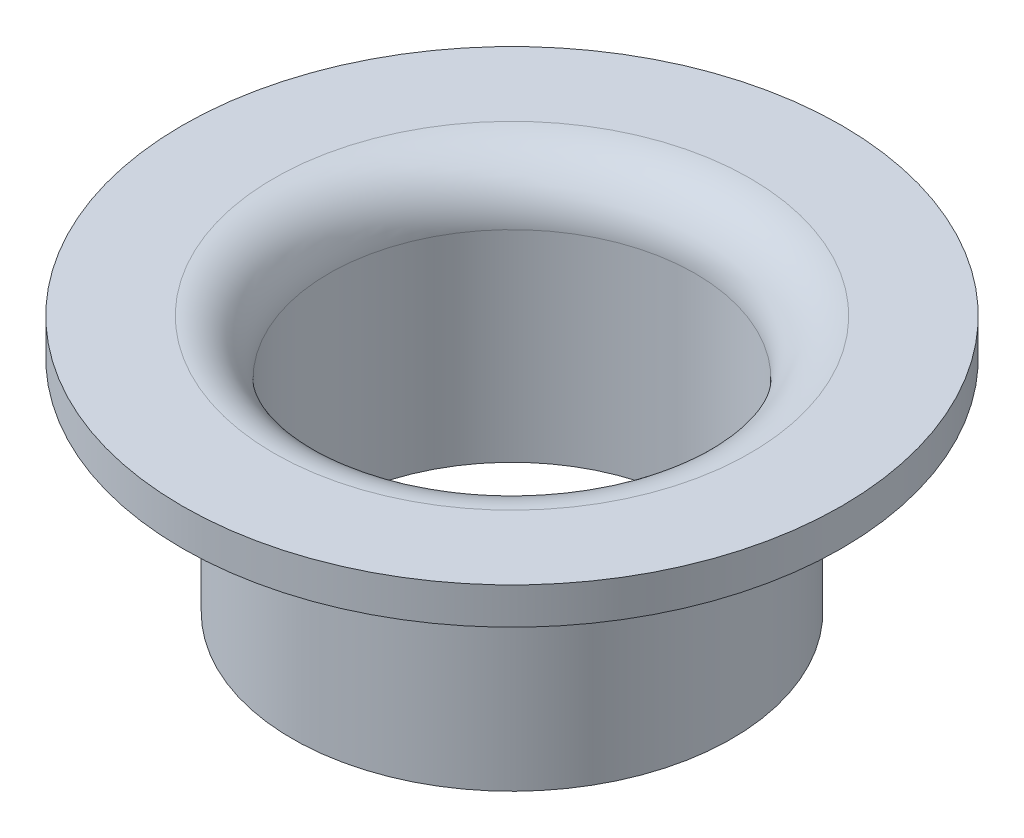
ISO-10303-21;
HEADER;
FILE_DESCRIPTION(('STEP AP214'),'2;1');
FILE_NAME('part.step','',(''),(''),'','','');
FILE_SCHEMA(('AUTOMOTIVE_DESIGN { 1 0 10303 214 1 1 1 1 }'));
ENDSEC;
DATA;
#1=APPLICATION_CONTEXT('core data for automotive mechanical design processes');
#2=APPLICATION_PROTOCOL_DEFINITION('international standard','automotive_design',2000,#1);
#3=PRODUCT_CONTEXT('',#1,'mechanical');
#4=PRODUCT('Part','Part','',(#3));
#5=PRODUCT_RELATED_PRODUCT_CATEGORY('part','',(#4));
#6=PRODUCT_DEFINITION_FORMATION('','',#4);
#7=PRODUCT_DEFINITION_CONTEXT('part definition',#1,'design');
#8=PRODUCT_DEFINITION('design','',#6,#7);
#9=PRODUCT_DEFINITION_SHAPE('','',#8);
#10=(LENGTH_UNIT() NAMED_UNIT(*) SI_UNIT(.MILLI.,.METRE.));
#11=(NAMED_UNIT(*) PLANE_ANGLE_UNIT() SI_UNIT($,.RADIAN.));
#12=(NAMED_UNIT(*) SI_UNIT($,.STERADIAN.) SOLID_ANGLE_UNIT());
#13=UNCERTAINTY_MEASURE_WITH_UNIT(LENGTH_MEASURE(1.E-05),#10,'distance_accuracy_value','');
#14=(GEOMETRIC_REPRESENTATION_CONTEXT(3) GLOBAL_UNCERTAINTY_ASSIGNED_CONTEXT((#13)) GLOBAL_UNIT_ASSIGNED_CONTEXT((#10,
#11,#12)) REPRESENTATION_CONTEXT('',''));
#15=CARTESIAN_POINT('',(0.,0.,0.));
#16=DIRECTION('',(0.,0.,1.));
#17=DIRECTION('',(1.,0.,0.));
#18=AXIS2_PLACEMENT_3D('',#15,#16,#17);
#19=CARTESIAN_POINT('',(0.,0.,0.));
#20=DIRECTION('',(0.,-1.,0.));
#21=DIRECTION('',(0.,0.,-0.99999999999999));
#22=AXIS2_PLACEMENT_3D('',#19,#20,#21);
#23=CYLINDRICAL_SURFACE('',#22,6.);
#24=CARTESIAN_POINT('',(0.,38.1455186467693,0.));
#25=DIRECTION('',(0.,-1.,0.));
#26=DIRECTION('',(0.,0.,-0.99999999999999));
#27=AXIS2_PLACEMENT_3D('',#24,#25,#26);
#28=CIRCLE('',#27,5.99999999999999);
#29=CARTESIAN_POINT('',(0.,38.1455186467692,-5.99999999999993));
#30=VERTEX_POINT('',#29);
#31=EDGE_CURVE('E52',#30,#30,#28,.T.);
#32=ORIENTED_EDGE('',*,*,#31,.T.);
#33=EDGE_LOOP('',(#32));
#34=FACE_BOUND('',#33,.T.);
#35=CARTESIAN_POINT('',(0.,32.6455186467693,0.));
#36=DIRECTION('',(0.,-1.,0.));
#37=DIRECTION('',(0.,0.,-0.99999999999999));
#38=AXIS2_PLACEMENT_3D('',#35,#36,#37);
#39=CIRCLE('',#38,6.);
#40=CARTESIAN_POINT('',(0.,32.6455186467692,-5.99999999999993));
#41=VERTEX_POINT('',#40);
#42=EDGE_CURVE('E10',#41,#41,#39,.T.);
#43=ORIENTED_EDGE('',*,*,#42,.F.);
#44=EDGE_LOOP('',(#43));
#45=FACE_BOUND('',#44,.T.);
#46=ADVANCED_FACE('F24',(#34,#45),#23,.T.);
#47=CARTESIAN_POINT('',(6.,32.6455186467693,0.));
#48=DIRECTION('',(0.,-1.,0.));
#49=DIRECTION('',(0.,0.,-0.99999999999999));
#50=AXIS2_PLACEMENT_3D('',#47,#48,#49);
#51=PLANE('',#50);
#52=ORIENTED_EDGE('',*,*,#42,.T.);
#53=EDGE_LOOP('',(#52));
#54=FACE_BOUND('',#53,.T.);
#55=CARTESIAN_POINT('',(0.,32.6455186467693,0.));
#56=DIRECTION('',(0.,-1.,0.));
#57=DIRECTION('',(0.,0.,-0.99999999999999));
#58=AXIS2_PLACEMENT_3D('',#55,#56,#57);
#59=CIRCLE('',#58,5.);
#60=CARTESIAN_POINT('',(0.,32.6455186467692,-4.99999999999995));
#61=VERTEX_POINT('',#60);
#62=EDGE_CURVE('E30',#61,#61,#59,.T.);
#63=ORIENTED_EDGE('',*,*,#62,.F.);
#64=EDGE_LOOP('',(#63));
#65=FACE_BOUND('',#64,.T.);
#66=ADVANCED_FACE('F70',(#54,#65),#51,.T.);
#67=CARTESIAN_POINT('',(0.,0.,0.));
#68=DIRECTION('',(0.,-1.,0.));
#69=DIRECTION('',(0.,0.,-0.99999999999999));
#70=AXIS2_PLACEMENT_3D('',#67,#68,#69);
#71=CYLINDRICAL_SURFACE('',#70,5.);
#72=ORIENTED_EDGE('',*,*,#62,.T.);
#73=EDGE_LOOP('',(#72));
#74=FACE_BOUND('',#73,.T.);
#75=CARTESIAN_POINT('',(0.,38.1455186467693,0.));
#76=DIRECTION('',(0.,-1.,0.));
#77=DIRECTION('',(0.,0.,-0.99999999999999));
#78=AXIS2_PLACEMENT_3D('',#75,#76,#77);
#79=CIRCLE('',#78,5.);
#80=CARTESIAN_POINT('',(0.,38.1455186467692,-4.99999999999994));
#81=VERTEX_POINT('',#80);
#82=EDGE_CURVE('E34',#81,#81,#79,.T.);
#83=ORIENTED_EDGE('',*,*,#82,.F.);
#84=EDGE_LOOP('',(#83));
#85=FACE_BOUND('',#84,.T.);
#86=ADVANCED_FACE('F74',(#74,#85),#71,.F.);
#87=CARTESIAN_POINT('',(0.,38.1455186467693,0.));
#88=DIRECTION('',(0.,-1.,0.));
#89=DIRECTION('',(0.,0.,-0.99999999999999));
#90=AXIS2_PLACEMENT_3D('',#87,#88,#89);
#91=TOROIDAL_SURFACE('',#90,6.5,1.5);
#92=ORIENTED_EDGE('',*,*,#82,.T.);
#93=EDGE_LOOP('',(#92));
#94=FACE_BOUND('',#93,.T.);
#95=CARTESIAN_POINT('',(0.,39.6455186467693,0.));
#96=DIRECTION('',(0.,-1.,0.));
#97=DIRECTION('',(0.,0.,-0.99999999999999));
#98=AXIS2_PLACEMENT_3D('',#95,#96,#97);
#99=CIRCLE('',#98,6.5);
#100=CARTESIAN_POINT('',(0.,39.6455186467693,-6.49999999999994));
#101=VERTEX_POINT('',#100);
#102=EDGE_CURVE('E38',#101,#101,#99,.T.);
#103=ORIENTED_EDGE('',*,*,#102,.F.);
#104=EDGE_LOOP('',(#103));
#105=FACE_BOUND('',#104,.T.);
#106=ADVANCED_FACE('F78',(#94,#105),#91,.T.);
#107=CARTESIAN_POINT('',(6.49999999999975,39.6455186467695,-1.59594559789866E-13));
#108=DIRECTION('',(0.,1.,0.));
#109=DIRECTION('',(0.,0.,0.99999999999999));
#110=AXIS2_PLACEMENT_3D('',#107,#108,#109);
#111=PLANE('',#110);
#112=ORIENTED_EDGE('',*,*,#102,.T.);
#113=EDGE_LOOP('',(#112));
#114=FACE_BOUND('',#113,.T.);
#115=CARTESIAN_POINT('',(0.,39.6455186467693,0.));
#116=DIRECTION('',(0.,-1.,0.));
#117=DIRECTION('',(0.,0.,-0.99999999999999));
#118=AXIS2_PLACEMENT_3D('',#115,#116,#117);
#119=CIRCLE('',#118,8.99999999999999);
#120=CARTESIAN_POINT('',(0.,39.6455186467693,-8.99999999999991));
#121=VERTEX_POINT('',#120);
#122=EDGE_CURVE('E43',#121,#121,#119,.T.);
#123=ORIENTED_EDGE('',*,*,#122,.F.);
#124=EDGE_LOOP('',(#123));
#125=FACE_BOUND('',#124,.T.);
#126=ADVANCED_FACE('F84',(#114,#125),#111,.T.);
#127=CARTESIAN_POINT('',(0.,0.,0.));
#128=DIRECTION('',(0.,-1.,0.));
#129=DIRECTION('',(0.,0.,-0.99999999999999));
#130=AXIS2_PLACEMENT_3D('',#127,#128,#129);
#131=CYLINDRICAL_SURFACE('',#130,8.99999999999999);
#132=ORIENTED_EDGE('',*,*,#122,.T.);
#133=EDGE_LOOP('',(#132));
#134=FACE_BOUND('',#133,.T.);
#135=CARTESIAN_POINT('',(-3.2612801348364E-13,38.6455186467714,-1.73472347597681E-13));
#136=DIRECTION('',(0.,-1.,0.));
#137=DIRECTION('',(0.,0.,-0.99999999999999));
#138=AXIS2_PLACEMENT_3D('',#135,#136,#137);
#139=CIRCLE('',#138,8.99999999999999);
#140=CARTESIAN_POINT('',(-3.67594843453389E-13,38.6455186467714,-9.00000000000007));
#141=VERTEX_POINT('',#140);
#142=EDGE_CURVE('E46',#141,#141,#139,.T.);
#143=ORIENTED_EDGE('',*,*,#142,.F.);
#144=EDGE_LOOP('',(#143));
#145=FACE_BOUND('',#144,.T.);
#146=ADVANCED_FACE('F66',(#134,#145),#131,.T.);
#147=CARTESIAN_POINT('',(8.99999999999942,38.6455186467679,-1.73472347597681E-13));
#148=DIRECTION('',(0.,-1.,0.));
#149=DIRECTION('',(0.,0.,-0.99999999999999));
#150=AXIS2_PLACEMENT_3D('',#147,#148,#149);
#151=PLANE('',#150);
#152=ORIENTED_EDGE('',*,*,#142,.T.);
#153=EDGE_LOOP('',(#152));
#154=FACE_BOUND('',#153,.T.);
#155=CARTESIAN_POINT('',(-3.2612801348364E-13,38.6455186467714,-1.73472347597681E-13));
#156=DIRECTION('',(0.,-1.,0.));
#157=DIRECTION('',(0.,0.,-0.99999999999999));
#158=AXIS2_PLACEMENT_3D('',#155,#156,#157);
#159=CIRCLE('',#158,6.5);
#160=CARTESIAN_POINT('',(-3.56076279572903E-13,38.6455186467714,-6.5000000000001));
#161=VERTEX_POINT('',#160);
#162=EDGE_CURVE('E49',#161,#161,#159,.T.);
#163=ORIENTED_EDGE('',*,*,#162,.F.);
#164=EDGE_LOOP('',(#163));
#165=FACE_BOUND('',#164,.T.);
#166=ADVANCED_FACE('F60',(#154,#165),#151,.T.);
#167=CARTESIAN_POINT('',(0.,38.1455186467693,0.));
#168=DIRECTION('',(0.,-1.,0.));
#169=DIRECTION('',(0.,0.,-0.99999999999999));
#170=AXIS2_PLACEMENT_3D('',#167,#168,#169);
#171=TOROIDAL_SURFACE('',#170,6.5,0.500000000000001);
#172=ORIENTED_EDGE('',*,*,#162,.T.);
#173=EDGE_LOOP('',(#172));
#174=FACE_BOUND('',#173,.T.);
#175=ORIENTED_EDGE('',*,*,#31,.F.);
#176=EDGE_LOOP('',(#175));
#177=FACE_BOUND('',#176,.T.);
#178=ADVANCED_FACE('F58',(#174,#177),#171,.F.);
#179=CLOSED_SHELL('',(#46,#66,#86,#106,#126,#146,#166,#178));
#180=MANIFOLD_SOLID_BREP('B2',#179);
#181=ADVANCED_BREP_SHAPE_REPRESENTATION('',(#18,#180),#14);
#182=SHAPE_DEFINITION_REPRESENTATION(#9,#181);
ENDSEC;
END-ISO-10303-21;
